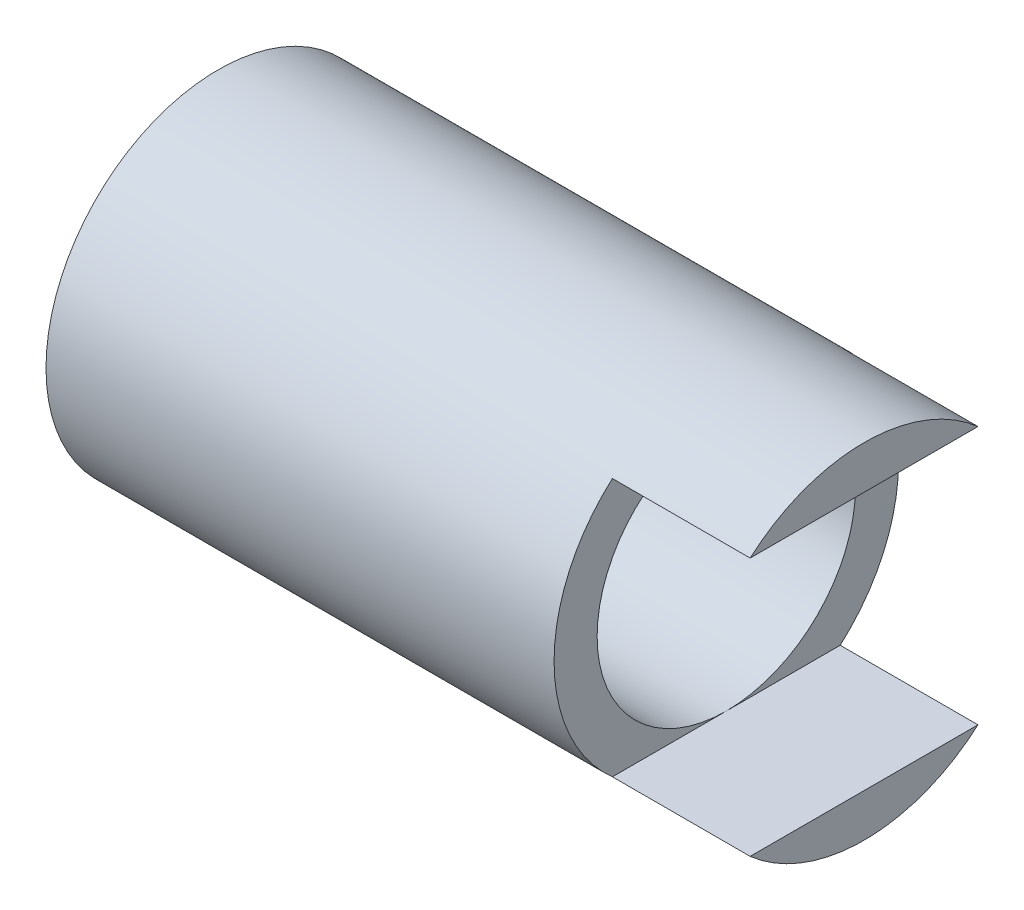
ISO-10303-21;
HEADER;
FILE_DESCRIPTION(('STEP AP214'),'2;1');
FILE_NAME('part.step','',(''),(''),'','','');
FILE_SCHEMA(('AUTOMOTIVE_DESIGN { 1 0 10303 214 1 1 1 1 }'));
ENDSEC;
DATA;
#1=APPLICATION_CONTEXT('core data for automotive mechanical design processes');
#2=APPLICATION_PROTOCOL_DEFINITION('international standard','automotive_design',2000,#1);
#3=PRODUCT_CONTEXT('',#1,'mechanical');
#4=PRODUCT('Part','Part','',(#3));
#5=PRODUCT_RELATED_PRODUCT_CATEGORY('part','',(#4));
#6=PRODUCT_DEFINITION_FORMATION('','',#4);
#7=PRODUCT_DEFINITION_CONTEXT('part definition',#1,'design');
#8=PRODUCT_DEFINITION('design','',#6,#7);
#9=PRODUCT_DEFINITION_SHAPE('','',#8);
#10=(LENGTH_UNIT() NAMED_UNIT(*) SI_UNIT(.MILLI.,.METRE.));
#11=(NAMED_UNIT(*) PLANE_ANGLE_UNIT() SI_UNIT($,.RADIAN.));
#12=(NAMED_UNIT(*) SI_UNIT($,.STERADIAN.) SOLID_ANGLE_UNIT());
#13=UNCERTAINTY_MEASURE_WITH_UNIT(LENGTH_MEASURE(1.E-05),#10,'distance_accuracy_value','');
#14=(GEOMETRIC_REPRESENTATION_CONTEXT(3) GLOBAL_UNCERTAINTY_ASSIGNED_CONTEXT((#13)) GLOBAL_UNIT_ASSIGNED_CONTEXT((#10,
#11,#12)) REPRESENTATION_CONTEXT('',''));
#15=CARTESIAN_POINT('',(0.,0.,0.));
#16=DIRECTION('',(0.,0.,1.));
#17=DIRECTION('',(1.,0.,0.));
#18=AXIS2_PLACEMENT_3D('',#15,#16,#17);
#19=CARTESIAN_POINT('',(-6.90087504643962,0.,0.));
#20=DIRECTION('',(-1.,0.,0.));
#21=DIRECTION('',(0.,0.,1.));
#22=AXIS2_PLACEMENT_3D('',#19,#20,#21);
#23=CYLINDRICAL_SURFACE('',#22,3.);
#24=CARTESIAN_POINT('',(0.,0.,0.));
#25=DIRECTION('',(-1.,0.,0.));
#26=DIRECTION('',(0.,0.,1.));
#27=AXIS2_PLACEMENT_3D('',#24,#25,#26);
#28=CIRCLE('',#27,3.);
#29=CARTESIAN_POINT('',(0.,-1.,-2.82842712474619));
#30=VERTEX_POINT('',#29);
#31=CARTESIAN_POINT('',(0.,1.,-2.82842712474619));
#32=VERTEX_POINT('',#31);
#33=EDGE_CURVE('E122',#30,#32,#28,.T.);
#34=ORIENTED_EDGE('',*,*,#33,.T.);
#35=DIRECTION('',(-1.,0.,0.));
#36=VECTOR('',#35,1.);
#37=CARTESIAN_POINT('',(-6.90087504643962,1.,-2.82842712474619));
#38=LINE('',#37,#36);
#39=CARTESIAN_POINT('',(6.5,1.,-2.82842712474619));
#40=VERTEX_POINT('',#39);
#41=EDGE_CURVE('E175',#32,#40,#38,.F.);
#42=ORIENTED_EDGE('',*,*,#41,.T.);
#43=CARTESIAN_POINT('',(6.5,1.,-2.82842712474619));
#44=CARTESIAN_POINT('',(6.52729049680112,1.0000007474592,-2.82842442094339));
#45=CARTESIAN_POINT('',(6.55456706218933,0.998882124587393,-2.82882259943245));
#46=CARTESIAN_POINT('',(6.6089085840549,0.994425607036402,-2.83039327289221));
#47=CARTESIAN_POINT('',(6.63597359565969,0.991088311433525,-2.83156555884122));
#48=CARTESIAN_POINT('',(6.71639214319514,0.977810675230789,-2.83619092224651));
#49=CARTESIAN_POINT('',(6.76918084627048,0.964604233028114,-2.84075292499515));
#50=CARTESIAN_POINT('',(6.87162519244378,0.929958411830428,-2.85228074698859));
#51=CARTESIAN_POINT('',(6.92128254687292,0.908523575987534,-2.85924523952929));
#52=CARTESIAN_POINT('',(7.01633983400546,0.858073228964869,-2.87478787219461));
#53=CARTESIAN_POINT('',(7.06173712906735,0.829053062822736,-2.88336700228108));
#54=CARTESIAN_POINT('',(7.14872023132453,0.763051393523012,-2.90154480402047));
#55=CARTESIAN_POINT('',(7.19011488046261,0.725824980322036,-2.91116877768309));
#56=CARTESIAN_POINT('',(7.2662060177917,0.644988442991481,-2.93013848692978));
#57=CARTESIAN_POINT('',(7.30090131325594,0.601377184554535,-2.93948417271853));
#58=CARTESIAN_POINT('',(7.3634795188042,0.507603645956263,-2.95713882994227));
#59=CARTESIAN_POINT('',(7.39116098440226,0.457300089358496,-2.96541437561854));
#60=CARTESIAN_POINT('',(7.43759225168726,0.352429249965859,-2.97969608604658));
#61=CARTESIAN_POINT('',(7.45634478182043,0.29786327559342,-2.9857029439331));
#62=CARTESIAN_POINT('',(7.48373572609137,0.188029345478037,-2.99459071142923));
#63=CARTESIAN_POINT('',(7.49270327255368,0.132851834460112,-2.99757308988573));
#64=CARTESIAN_POINT('',(7.50131629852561,0.0216989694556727,-3.00043608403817));
#65=CARTESIAN_POINT('',(7.50096399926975,-0.0342761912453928,-3.00031743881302));
#66=CARTESIAN_POINT('',(7.49115571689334,-0.143103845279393,-2.99706038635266));
#67=CARTESIAN_POINT('',(7.48205736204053,-0.195992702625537,-2.99404060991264));
#68=CARTESIAN_POINT('',(7.45560680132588,-0.299444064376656,-2.98546960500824));
#69=CARTESIAN_POINT('',(7.43825413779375,-0.350006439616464,-2.97991823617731));
#70=CARTESIAN_POINT('',(7.39557863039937,-0.448152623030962,-2.96675668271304));
#71=CARTESIAN_POINT('',(7.37015395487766,-0.495688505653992,-2.95912037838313));
#72=CARTESIAN_POINT('',(7.3121400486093,-0.585924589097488,-2.94258387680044));
#73=CARTESIAN_POINT('',(7.27954886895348,-0.628623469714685,-2.93368333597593));
#74=CARTESIAN_POINT('',(7.20632895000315,-0.710097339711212,-2.91506271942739));
#75=CARTESIAN_POINT('',(7.16539445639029,-0.748593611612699,-2.90532378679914));
#76=CARTESIAN_POINT('',(7.07755851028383,-0.818272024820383,-2.88647490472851));
#77=CARTESIAN_POINT('',(7.03065513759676,-0.849451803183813,-2.87736515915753));
#78=CARTESIAN_POINT('',(6.93131982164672,-0.904003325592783,-2.86070031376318));
#79=CARTESIAN_POINT('',(6.87881648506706,-0.927253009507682,-2.85317014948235));
#80=CARTESIAN_POINT('',(6.77035302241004,-0.964460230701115,-2.84081097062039));
#81=CARTESIAN_POINT('',(6.71439850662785,-0.978432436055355,-2.83597769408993));
#82=CARTESIAN_POINT('',(6.63158136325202,-0.991658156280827,-2.8313654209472));
#83=CARTESIAN_POINT('',(6.60535861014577,-0.994785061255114,-2.83026667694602));
#84=CARTESIAN_POINT('',(6.55276192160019,-0.998954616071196,-2.82879703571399));
#85=CARTESIAN_POINT('',(6.5263882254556,-0.999999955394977,-2.82842519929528));
#86=CARTESIAN_POINT('',(6.5,-0.999999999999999,-2.82842712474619));
#87=B_SPLINE_CURVE_WITH_KNOTS('',3,(#43,#44,#45,#46,#47,#48,#49,#50,#51,#52,#53,#54,#55,#56,#57,
#58,#59,#60,#61,#62,#63,#64,#65,#66,#67,#68,#69,#70,#71,#72,#73,#74,#75,#76,#77,#78,#79,#80,#81,
#82,#83,#84,#85,#86),.UNSPECIFIED.,.F.,.F.,(4,2,2,2,2,2,2,2,2,2,2,2,2,2,2,2,2,2,2,2,2,4),(0.,
0.0818184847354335,0.163614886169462,0.326581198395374,0.489457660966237,0.652434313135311,
0.821165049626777,0.989925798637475,1.16309132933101,1.33620391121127,1.50329470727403,
1.67034568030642,1.83084418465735,1.99135158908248,2.15397018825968,2.31663306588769,
2.4869405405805,2.65730294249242,2.8301802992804,3.00278367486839,3.08199895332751,
3.16111181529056),.UNSPECIFIED.);
#88=CARTESIAN_POINT('',(6.5,-0.999999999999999,-2.82842712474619));
#89=VERTEX_POINT('',#88);
#90=EDGE_CURVE('E123',#40,#89,#87,.T.);
#91=ORIENTED_EDGE('',*,*,#90,.T.);
#92=DIRECTION('',(-1.,0.,0.));
#93=VECTOR('',#92,1.);
#94=CARTESIAN_POINT('',(-6.90087504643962,-1.,-2.82842712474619));
#95=LINE('',#94,#93);
#96=EDGE_CURVE('E109',#89,#30,#95,.T.);
#97=ORIENTED_EDGE('',*,*,#96,.T.);
#98=EDGE_LOOP('',(#34,#42,#91,#97));
#99=FACE_BOUND('',#98,.T.);
#100=CARTESIAN_POINT('',(11.8,0.,0.));
#101=DIRECTION('',(1.,0.,0.));
#102=DIRECTION('',(0.,0.,-1.));
#103=AXIS2_PLACEMENT_3D('',#100,#101,#102);
#104=CIRCLE('',#103,3.);
#105=CARTESIAN_POINT('',(11.8,-3.,0.));
#106=VERTEX_POINT('',#105);
#107=CARTESIAN_POINT('',(11.8,3.,0.));
#108=VERTEX_POINT('',#107);
#109=EDGE_CURVE('E115',#106,#108,#104,.F.);
#110=ORIENTED_EDGE('',*,*,#109,.F.);
#111=EDGE_CURVE('E143',#108,#106,#104,.F.);
#112=ORIENTED_EDGE('',*,*,#111,.F.);
#113=EDGE_LOOP('',(#110,#112));
#114=FACE_BOUND('',#113,.T.);
#115=ADVANCED_FACE('F32',(#99,#114),#23,.F.);
#116=CARTESIAN_POINT('',(15.,3.,0.));
#117=DIRECTION('',(-1.,0.,0.));
#118=DIRECTION('',(0.,0.,1.));
#119=AXIS2_PLACEMENT_3D('',#116,#117,#118);
#120=PLANE('',#119);
#121=CARTESIAN_POINT('',(15.,0.,0.));
#122=DIRECTION('',(-1.,0.,0.));
#123=DIRECTION('',(0.,0.,1.));
#124=AXIS2_PLACEMENT_3D('',#121,#122,#123);
#125=CIRCLE('',#124,4.);
#126=CARTESIAN_POINT('',(15.,3.,2.64575131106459));
#127=VERTEX_POINT('',#126);
#128=CARTESIAN_POINT('',(15.,3.,-2.64575131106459));
#129=VERTEX_POINT('',#128);
#130=EDGE_CURVE('E129',#127,#129,#125,.T.);
#131=ORIENTED_EDGE('',*,*,#130,.F.);
#132=DIRECTION('',(0.,0.,-1.));
#133=VECTOR('',#132,1.);
#134=CARTESIAN_POINT('',(15.,3.,0.));
#135=LINE('',#134,#133);
#136=EDGE_CURVE('E140',#127,#129,#135,.T.);
#137=ORIENTED_EDGE('',*,*,#136,.T.);
#138=EDGE_LOOP('',(#131,#137));
#139=FACE_BOUND('',#138,.T.);
#140=ADVANCED_FACE('F158',(#139),#120,.F.);
#141=CARTESIAN_POINT('',(-6.90087504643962,0.,0.));
#142=DIRECTION('',(-1.,0.,0.));
#143=DIRECTION('',(0.,0.,1.));
#144=AXIS2_PLACEMENT_3D('',#141,#142,#143);
#145=CYLINDRICAL_SURFACE('',#144,4.);
#146=CARTESIAN_POINT('',(11.8,0.,0.));
#147=DIRECTION('',(1.,0.,0.));
#148=DIRECTION('',(0.,0.,-1.));
#149=AXIS2_PLACEMENT_3D('',#146,#147,#148);
#150=CIRCLE('',#149,4.);
#151=CARTESIAN_POINT('',(11.8,3.,2.64575131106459));
#152=VERTEX_POINT('',#151);
#153=CARTESIAN_POINT('',(11.8,-3.,2.64575131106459));
#154=VERTEX_POINT('',#153);
#155=EDGE_CURVE('E212',#152,#154,#150,.T.);
#156=ORIENTED_EDGE('',*,*,#155,.F.);
#157=DIRECTION('',(-1.,0.,0.));
#158=VECTOR('',#157,1.);
#159=CARTESIAN_POINT('',(-6.90087504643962,3.,2.64575131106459));
#160=LINE('',#159,#158);
#161=EDGE_CURVE('E216',#152,#127,#160,.F.);
#162=ORIENTED_EDGE('',*,*,#161,.T.);
#163=ORIENTED_EDGE('',*,*,#130,.T.);
#164=DIRECTION('',(-1.,0.,0.));
#165=VECTOR('',#164,1.);
#166=CARTESIAN_POINT('',(-6.90087504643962,3.,-2.64575131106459));
#167=LINE('',#166,#165);
#168=CARTESIAN_POINT('',(11.8,3.,-2.64575131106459));
#169=VERTEX_POINT('',#168);
#170=EDGE_CURVE('E213',#129,#169,#167,.T.);
#171=ORIENTED_EDGE('',*,*,#170,.T.);
#172=CARTESIAN_POINT('',(11.8,-3.,-2.64575131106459));
#173=VERTEX_POINT('',#172);
#174=EDGE_CURVE('E210',#173,#169,#150,.T.);
#175=ORIENTED_EDGE('',*,*,#174,.F.);
#176=DIRECTION('',(-1.,0.,0.));
#177=VECTOR('',#176,1.);
#178=CARTESIAN_POINT('',(-6.90087504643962,-3.,-2.64575131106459));
#179=LINE('',#178,#177);
#180=CARTESIAN_POINT('',(15.,-3.,-2.64575131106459));
#181=VERTEX_POINT('',#180);
#182=EDGE_CURVE('E200',#173,#181,#179,.F.);
#183=ORIENTED_EDGE('',*,*,#182,.T.);
#184=CARTESIAN_POINT('',(15.,-3.,2.64575131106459));
#185=VERTEX_POINT('',#184);
#186=EDGE_CURVE('E134',#181,#185,#125,.T.);
#187=ORIENTED_EDGE('',*,*,#186,.T.);
#188=DIRECTION('',(-1.,0.,0.));
#189=VECTOR('',#188,1.);
#190=CARTESIAN_POINT('',(-6.90087504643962,-3.,2.64575131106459));
#191=LINE('',#190,#189);
#192=EDGE_CURVE('E202',#185,#154,#191,.T.);
#193=ORIENTED_EDGE('',*,*,#192,.T.);
#194=EDGE_LOOP('',(#156,#162,#163,#171,#175,#183,#187,#193));
#195=FACE_BOUND('',#194,.T.);
#196=DIRECTION('',(-1.,0.,0.));
#197=VECTOR('',#196,1.);
#198=CARTESIAN_POINT('',(-6.90087504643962,-1.,-3.87298334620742));
#199=LINE('',#198,#197);
#200=CARTESIAN_POINT('',(0.,-1.,-3.87298334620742));
#201=VERTEX_POINT('',#200);
#202=CARTESIAN_POINT('',(6.5,-0.999999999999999,-3.87298334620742));
#203=VERTEX_POINT('',#202);
#204=EDGE_CURVE('E52',#201,#203,#199,.F.);
#205=ORIENTED_EDGE('',*,*,#204,.T.);
#206=CARTESIAN_POINT('',(6.5,-0.999999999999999,-3.87298334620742));
#207=CARTESIAN_POINT('',(6.52766298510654,-1.00000033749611,-3.87298148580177));
#208=CARTESIAN_POINT('',(6.55531226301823,-0.998851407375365,-3.87328009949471));
#209=CARTESIAN_POINT('',(6.61040403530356,-0.994271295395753,-3.87445904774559));
#210=CARTESIAN_POINT('',(6.63784656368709,-0.990840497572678,-3.87533928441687));
#211=CARTESIAN_POINT('',(6.71945317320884,-0.977175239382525,-3.87881710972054));
#212=CARTESIAN_POINT('',(6.77305646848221,-0.963567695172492,-3.88225203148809));
#213=CARTESIAN_POINT('',(6.87712467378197,-0.927798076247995,-3.89095422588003));
#214=CARTESIAN_POINT('',(6.92758987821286,-0.905636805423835,-3.8962213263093));
#215=CARTESIAN_POINT('',(7.02411144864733,-0.853415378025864,-3.90799134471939));
#216=CARTESIAN_POINT('',(7.07016662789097,-0.823353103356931,-3.91449459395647));
#217=CARTESIAN_POINT('',(7.1575438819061,-0.755484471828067,-3.92816262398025));
#218=CARTESIAN_POINT('',(7.19875488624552,-0.717537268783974,-3.93533791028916));
#219=CARTESIAN_POINT('',(7.27430208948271,-0.635275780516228,-3.94945104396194));
#220=CARTESIAN_POINT('',(7.30863718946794,-0.590960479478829,-3.95638885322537));
#221=CARTESIAN_POINT('',(7.36991100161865,-0.496456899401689,-3.96936182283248));
#222=CARTESIAN_POINT('',(7.39673989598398,-0.446195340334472,-3.9753830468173));
#223=CARTESIAN_POINT('',(7.44152473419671,-0.341702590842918,-3.98572346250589));
#224=CARTESIAN_POINT('',(7.45948242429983,-0.287472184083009,-3.99004298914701));
#225=CARTESIAN_POINT('',(7.48565899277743,-0.177744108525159,-3.99641900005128));
#226=CARTESIAN_POINT('',(7.49406767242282,-0.122294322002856,-3.99851952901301));
#227=CARTESIAN_POINT('',(7.5015033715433,-0.0107327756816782,-4.00037438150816));
#228=CARTESIAN_POINT('',(7.50053157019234,0.0453789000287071,-4.00012899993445));
#229=CARTESIAN_POINT('',(7.48937003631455,0.155352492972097,-3.99735237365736));
#230=CARTESIAN_POINT('',(7.47938538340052,0.209236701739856,-3.99487198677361));
#231=CARTESIAN_POINT('',(7.45081132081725,0.314538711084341,-3.98796330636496));
#232=CARTESIAN_POINT('',(7.43222153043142,0.365956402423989,-3.98353492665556));
#233=CARTESIAN_POINT('',(7.38679871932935,0.46540728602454,-3.97314997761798));
#234=CARTESIAN_POINT('',(7.35989260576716,0.513405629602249,-3.96717993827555));
#235=CARTESIAN_POINT('',(7.29865687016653,0.604276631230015,-3.95435945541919));
#236=CARTESIAN_POINT('',(7.26432612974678,0.647148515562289,-3.94750887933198));
#237=CARTESIAN_POINT('',(7.18812108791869,0.727769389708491,-3.93345566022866));
#238=CARTESIAN_POINT('',(7.14606836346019,0.765349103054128,-3.92624850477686));
#239=CARTESIAN_POINT('',(7.05617013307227,0.832969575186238,-3.91246168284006));
#240=CARTESIAN_POINT('',(7.00832304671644,0.863008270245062,-3.90588218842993));
#241=CARTESIAN_POINT('',(6.90785440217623,0.914804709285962,-3.89407813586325));
#242=CARTESIAN_POINT('',(6.85520853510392,0.936517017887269,-3.88886106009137));
#243=CARTESIAN_POINT('',(6.74688307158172,0.970702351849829,-3.88047058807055));
#244=CARTESIAN_POINT('',(6.69120814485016,0.983189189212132,-3.87729413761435));
#245=CARTESIAN_POINT('',(6.6125426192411,0.993904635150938,-3.87455290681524));
#246=CARTESIAN_POINT('',(6.59008029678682,0.996190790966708,-3.8739652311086));
#247=CARTESIAN_POINT('',(6.54508221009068,0.999236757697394,-3.87318062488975));
#248=CARTESIAN_POINT('',(6.52254662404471,0.999999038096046,-3.87298306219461));
#249=CARTESIAN_POINT('',(6.5,1.,-3.87298334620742));
#250=B_SPLINE_CURVE_WITH_KNOTS('',3,(#206,#207,#208,#209,#210,#211,#212,#213,#214,#215,#216,
#217,#218,#219,#220,#221,#222,#223,#224,#225,#226,#227,#228,#229,#230,#231,#232,#233,#234,#235,
#236,#237,#238,#239,#240,#241,#242,#243,#244,#245,#246,#247,#248,#249),.UNSPECIFIED.,.F.,.F.,(4,
2,2,2,2,2,2,2,2,2,2,2,2,2,2,2,2,2,2,2,2,4),(0.,0.0829365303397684,0.16585910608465,
0.331229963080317,0.496585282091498,0.66198497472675,0.830641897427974,0.999325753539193,
1.17036187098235,1.34136430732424,1.50890481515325,1.67642426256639,1.84022545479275,
2.00403389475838,2.16932509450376,2.33464120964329,2.50441429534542,2.67423379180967,
2.84496720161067,3.01544447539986,3.08315848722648,3.15076267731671),.UNSPECIFIED.);
#251=CARTESIAN_POINT('',(6.5,1.,-3.87298334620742));
#252=VERTEX_POINT('',#251);
#253=EDGE_CURVE('E11',#203,#252,#250,.T.);
#254=ORIENTED_EDGE('',*,*,#253,.T.);
#255=DIRECTION('',(-1.,0.,0.));
#256=VECTOR('',#255,1.);
#257=CARTESIAN_POINT('',(-6.90087504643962,1.,-3.87298334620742));
#258=LINE('',#257,#256);
#259=CARTESIAN_POINT('',(0.,1.,-3.87298334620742));
#260=VERTEX_POINT('',#259);
#261=EDGE_CURVE('E124',#252,#260,#258,.T.);
#262=ORIENTED_EDGE('',*,*,#261,.T.);
#263=CARTESIAN_POINT('',(0.,0.,0.));
#264=DIRECTION('',(-1.,0.,0.));
#265=DIRECTION('',(0.,0.,1.));
#266=AXIS2_PLACEMENT_3D('',#263,#264,#265);
#267=CIRCLE('',#266,4.);
#268=EDGE_CURVE('E128',#201,#260,#267,.T.);
#269=ORIENTED_EDGE('',*,*,#268,.F.);
#270=EDGE_LOOP('',(#205,#254,#262,#269));
#271=FACE_BOUND('',#270,.T.);
#272=ADVANCED_FACE('F34',(#195,#271),#145,.T.);
#273=CARTESIAN_POINT('',(0.,4.,0.));
#274=DIRECTION('',(1.,0.,0.));
#275=DIRECTION('',(0.,0.,-1.));
#276=AXIS2_PLACEMENT_3D('',#273,#274,#275);
#277=PLANE('',#276);
#278=ORIENTED_EDGE('',*,*,#268,.T.);
#279=DIRECTION('',(0.,0.,1.));
#280=VECTOR('',#279,1.);
#281=CARTESIAN_POINT('',(0.,1.,0.));
#282=LINE('',#281,#280);
#283=EDGE_CURVE('E45',#260,#32,#282,.T.);
#284=ORIENTED_EDGE('',*,*,#283,.T.);
#285=ORIENTED_EDGE('',*,*,#33,.F.);
#286=DIRECTION('',(0.,0.,-1.));
#287=VECTOR('',#286,1.);
#288=CARTESIAN_POINT('',(0.,-1.,0.));
#289=LINE('',#288,#287);
#290=EDGE_CURVE('E106',#30,#201,#289,.T.);
#291=ORIENTED_EDGE('',*,*,#290,.T.);
#292=EDGE_LOOP('',(#278,#284,#285,#291));
#293=FACE_BOUND('',#292,.T.);
#294=ADVANCED_FACE('F127',(#293),#277,.F.);
#295=ORIENTED_EDGE('',*,*,#186,.F.);
#296=DIRECTION('',(0.,0.,1.));
#297=VECTOR('',#296,1.);
#298=CARTESIAN_POINT('',(15.,-3.,0.));
#299=LINE('',#298,#297);
#300=EDGE_CURVE('E131',#181,#185,#299,.T.);
#301=ORIENTED_EDGE('',*,*,#300,.T.);
#302=EDGE_LOOP('',(#295,#301));
#303=FACE_BOUND('',#302,.T.);
#304=ADVANCED_FACE('F165',(#303),#120,.F.);
#305=CARTESIAN_POINT('',(11.8,0.,0.));
#306=DIRECTION('',(1.,0.,0.));
#307=DIRECTION('',(0.,0.,-1.));
#308=AXIS2_PLACEMENT_3D('',#305,#306,#307);
#309=PLANE('',#308);
#310=ORIENTED_EDGE('',*,*,#155,.T.);
#311=DIRECTION('',(0.,0.,-1.));
#312=VECTOR('',#311,1.);
#313=CARTESIAN_POINT('',(11.8,-3.,-5.));
#314=LINE('',#313,#312);
#315=EDGE_CURVE('E156',#154,#106,#314,.T.);
#316=ORIENTED_EDGE('',*,*,#315,.T.);
#317=ORIENTED_EDGE('',*,*,#109,.T.);
#318=DIRECTION('',(0.,0.,1.));
#319=VECTOR('',#318,1.);
#320=CARTESIAN_POINT('',(11.8,3.,-5.));
#321=LINE('',#320,#319);
#322=EDGE_CURVE('E153',#108,#152,#321,.T.);
#323=ORIENTED_EDGE('',*,*,#322,.T.);
#324=EDGE_LOOP('',(#310,#316,#317,#323));
#325=FACE_BOUND('',#324,.T.);
#326=ADVANCED_FACE('F152',(#325),#309,.T.);
#327=ORIENTED_EDGE('',*,*,#174,.T.);
#328=EDGE_CURVE('E60',#169,#108,#321,.T.);
#329=ORIENTED_EDGE('',*,*,#328,.T.);
#330=ORIENTED_EDGE('',*,*,#111,.T.);
#331=EDGE_CURVE('E174',#106,#173,#314,.T.);
#332=ORIENTED_EDGE('',*,*,#331,.T.);
#333=EDGE_LOOP('',(#327,#329,#330,#332));
#334=FACE_BOUND('',#333,.T.);
#335=ADVANCED_FACE('F191',(#334),#309,.T.);
#336=CARTESIAN_POINT('',(11.8,3.,-5.));
#337=DIRECTION('',(0.,1.,0.));
#338=DIRECTION('',(0.,0.,1.));
#339=AXIS2_PLACEMENT_3D('',#336,#337,#338);
#340=PLANE('',#339);
#341=ORIENTED_EDGE('',*,*,#136,.F.);
#342=ORIENTED_EDGE('',*,*,#161,.F.);
#343=ORIENTED_EDGE('',*,*,#322,.F.);
#344=ORIENTED_EDGE('',*,*,#328,.F.);
#345=ORIENTED_EDGE('',*,*,#170,.F.);
#346=EDGE_LOOP('',(#341,#342,#343,#344,#345));
#347=FACE_BOUND('',#346,.T.);
#348=ADVANCED_FACE('F192',(#347),#340,.F.);
#349=CARTESIAN_POINT('',(11.8,-3.,-5.));
#350=DIRECTION('',(0.,-1.,0.));
#351=DIRECTION('',(0.,0.,-1.));
#352=AXIS2_PLACEMENT_3D('',#349,#350,#351);
#353=PLANE('',#352);
#354=ORIENTED_EDGE('',*,*,#300,.F.);
#355=ORIENTED_EDGE('',*,*,#182,.F.);
#356=ORIENTED_EDGE('',*,*,#331,.F.);
#357=ORIENTED_EDGE('',*,*,#315,.F.);
#358=ORIENTED_EDGE('',*,*,#192,.F.);
#359=EDGE_LOOP('',(#354,#355,#356,#357,#358));
#360=FACE_BOUND('',#359,.T.);
#361=ADVANCED_FACE('F184',(#360),#353,.F.);
#362=CARTESIAN_POINT('',(6.5,0.,-4.));
#363=DIRECTION('',(0.,0.,1.));
#364=DIRECTION('',(1.,0.,0.));
#365=AXIS2_PLACEMENT_3D('',#362,#363,#364);
#366=CYLINDRICAL_SURFACE('',#365,1.);
#367=DIRECTION('',(0.,0.,1.));
#368=VECTOR('',#367,1.);
#369=CARTESIAN_POINT('',(6.5,1.,-4.));
#370=LINE('',#369,#368);
#371=EDGE_CURVE('E284',#252,#40,#370,.T.);
#372=ORIENTED_EDGE('',*,*,#371,.F.);
#373=ORIENTED_EDGE('',*,*,#253,.F.);
#374=DIRECTION('',(0.,0.,1.));
#375=VECTOR('',#374,1.);
#376=CARTESIAN_POINT('',(6.5,-0.999999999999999,-4.));
#377=LINE('',#376,#375);
#378=EDGE_CURVE('E285',#203,#89,#377,.T.);
#379=ORIENTED_EDGE('',*,*,#378,.T.);
#380=ORIENTED_EDGE('',*,*,#90,.F.);
#381=EDGE_LOOP('',(#372,#373,#379,#380));
#382=FACE_BOUND('',#381,.T.);
#383=ADVANCED_FACE('F178',(#382),#366,.F.);
#384=CARTESIAN_POINT('',(0.,1.,-4.));
#385=DIRECTION('',(0.,1.,0.));
#386=DIRECTION('',(-1.,0.,0.));
#387=AXIS2_PLACEMENT_3D('',#384,#385,#386);
#388=PLANE('',#387);
#389=ORIENTED_EDGE('',*,*,#283,.F.);
#390=ORIENTED_EDGE('',*,*,#261,.F.);
#391=ORIENTED_EDGE('',*,*,#371,.T.);
#392=ORIENTED_EDGE('',*,*,#41,.F.);
#393=EDGE_LOOP('',(#389,#390,#391,#392));
#394=FACE_BOUND('',#393,.T.);
#395=ADVANCED_FACE('F183',(#394),#388,.F.);
#396=CARTESIAN_POINT('',(6.5,-0.999999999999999,-4.));
#397=DIRECTION('',(0.,-1.,0.));
#398=DIRECTION('',(1.,0.,0.));
#399=AXIS2_PLACEMENT_3D('',#396,#397,#398);
#400=PLANE('',#399);
#401=ORIENTED_EDGE('',*,*,#378,.F.);
#402=ORIENTED_EDGE('',*,*,#204,.F.);
#403=ORIENTED_EDGE('',*,*,#290,.F.);
#404=ORIENTED_EDGE('',*,*,#96,.F.);
#405=EDGE_LOOP('',(#401,#402,#403,#404));
#406=FACE_BOUND('',#405,.T.);
#407=ADVANCED_FACE('F108',(#406),#400,.F.);
#408=CLOSED_SHELL('',(#115,#140,#272,#294,#304,#326,#335,#348,#361,#383,#395,#407));
#409=MANIFOLD_SOLID_BREP('B2',#408);
#410=ADVANCED_BREP_SHAPE_REPRESENTATION('',(#18,#409),#14);
#411=SHAPE_DEFINITION_REPRESENTATION(#9,#410);
ENDSEC;
END-ISO-10303-21;
